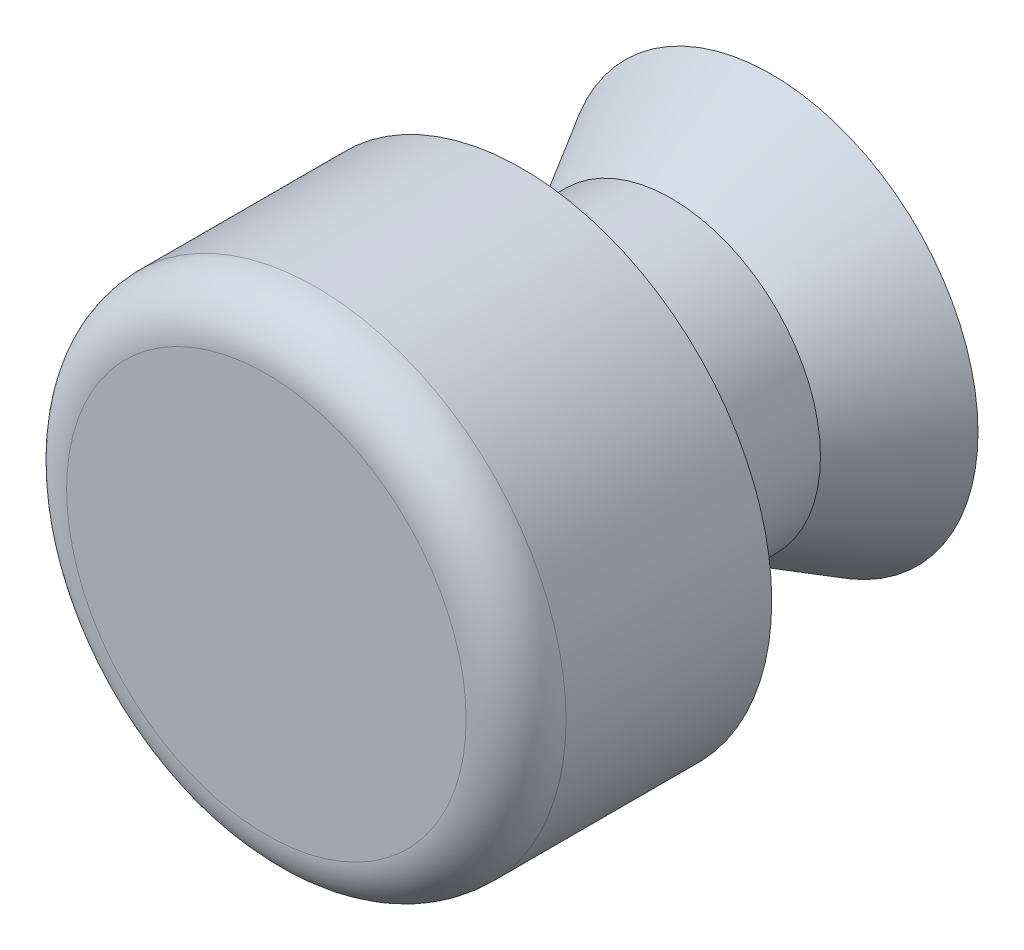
from build123d import *


with BuildPart() as part:
    # Sketch 1 → Revolve 1 (revolve)
    with BuildSketch(Plane(origin=(0, 0, 0), x_dir=(0, 0, -1), z_dir=(1, 0, 0)), mode=Mode.PRIVATE) as revolve_1_sk:
        with BuildLine():
            Line((0, 0), (8.0264, 0))
            Line((8.0264, 0), (8.0264, 3.285093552))
            Line((8.0264, 3.285093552), (6.4389, 2.36855))
            Line((6.4389, 2.36855), (4.064, 2.36855))
            Line((4.064, 2.36855), (4.064, 3.96875))
            Line((4.064, 3.96875), (0.79375, 3.96875))
            ThreePointArc((0.79375, 3.96875), (0.232483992, 3.736266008), (0, 3.175))
            Line((0, 3.175), (0, 0))
        make_face()
    revolve(revolve_1_sk.sketch.rotate(Axis((0, 0, 0), (0, 0, -1)), 90), axis=Axis((0, 0, 0), (0, 0, -1)))


solid = part.part
